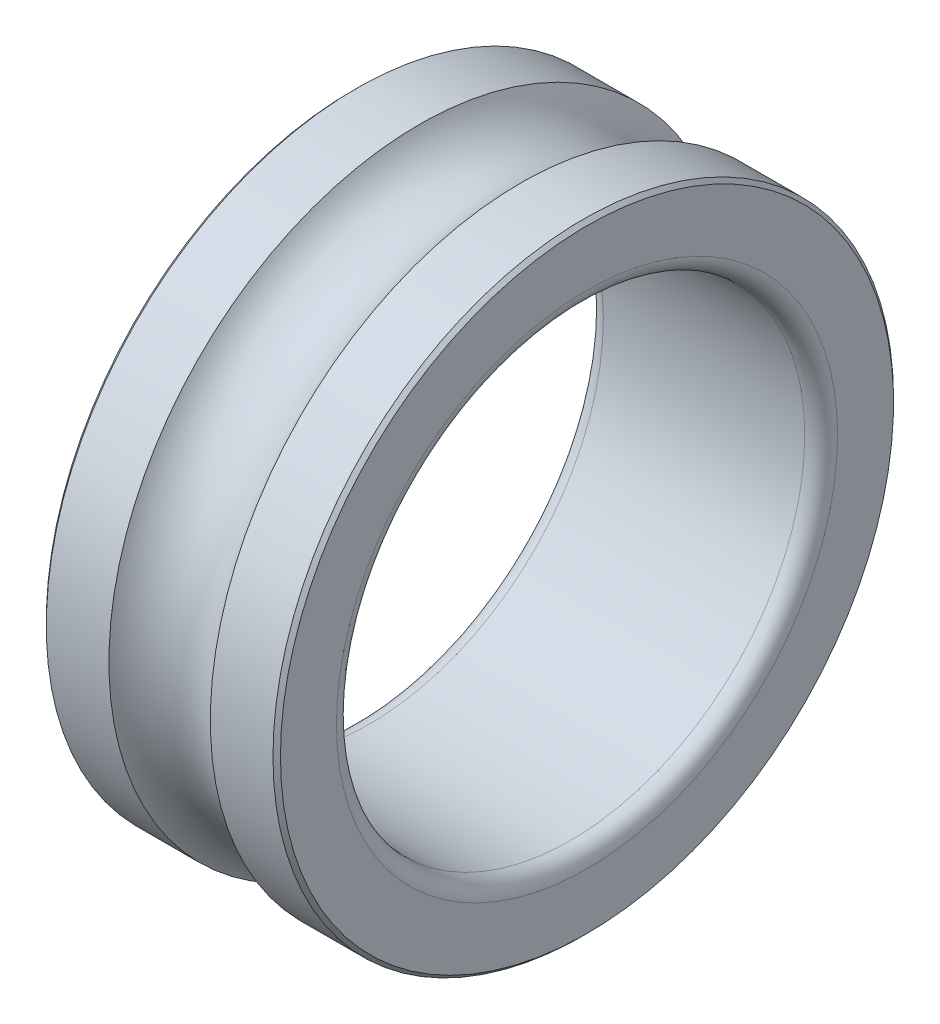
ISO-10303-21;
HEADER;
FILE_DESCRIPTION(('STEP AP214'),'2;1');
FILE_NAME('part.step','',(''),(''),'','','');
FILE_SCHEMA(('AUTOMOTIVE_DESIGN { 1 0 10303 214 1 1 1 1 }'));
ENDSEC;
DATA;
#1=APPLICATION_CONTEXT('core data for automotive mechanical design processes');
#2=APPLICATION_PROTOCOL_DEFINITION('international standard','automotive_design',2000,#1);
#3=PRODUCT_CONTEXT('',#1,'mechanical');
#4=PRODUCT('Part','Part','',(#3));
#5=PRODUCT_RELATED_PRODUCT_CATEGORY('part','',(#4));
#6=PRODUCT_DEFINITION_FORMATION('','',#4);
#7=PRODUCT_DEFINITION_CONTEXT('part definition',#1,'design');
#8=PRODUCT_DEFINITION('design','',#6,#7);
#9=PRODUCT_DEFINITION_SHAPE('','',#8);
#10=(LENGTH_UNIT() NAMED_UNIT(*) SI_UNIT(.MILLI.,.METRE.));
#11=(NAMED_UNIT(*) PLANE_ANGLE_UNIT() SI_UNIT($,.RADIAN.));
#12=(NAMED_UNIT(*) SI_UNIT($,.STERADIAN.) SOLID_ANGLE_UNIT());
#13=UNCERTAINTY_MEASURE_WITH_UNIT(LENGTH_MEASURE(1.E-05),#10,'distance_accuracy_value','');
#14=(GEOMETRIC_REPRESENTATION_CONTEXT(3) GLOBAL_UNCERTAINTY_ASSIGNED_CONTEXT((#13)) GLOBAL_UNIT_ASSIGNED_CONTEXT((#10,
#11,#12)) REPRESENTATION_CONTEXT('',''));
#15=CARTESIAN_POINT('',(0.,0.,0.));
#16=DIRECTION('',(0.,0.,1.));
#17=DIRECTION('',(1.,0.,0.));
#18=AXIS2_PLACEMENT_3D('',#15,#16,#17);
#19=CARTESIAN_POINT('',(-2.5,0.,0.));
#20=DIRECTION('',(1.,0.,0.));
#21=DIRECTION('',(0.,0.,-1.));
#22=AXIS2_PLACEMENT_3D('',#19,#20,#21);
#23=TOROIDAL_SURFACE('',#22,7.25,1.25);
#24=CARTESIAN_POINT('',(-1.41746824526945,0.,0.));
#25=DIRECTION('',(1.,0.,0.));
#26=DIRECTION('',(0.,0.,-1.));
#27=AXIS2_PLACEMENT_3D('',#24,#25,#26);
#28=CIRCLE('',#27,6.625);
#29=CARTESIAN_POINT('',(-1.41746824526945,0.,-6.625));
#30=VERTEX_POINT('',#29);
#31=EDGE_CURVE('E165',#30,#30,#28,.T.);
#32=ORIENTED_EDGE('',*,*,#31,.F.);
#33=EDGE_LOOP('',(#32));
#34=FACE_BOUND('',#33,.T.);
#35=CARTESIAN_POINT('',(-3.58253175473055,0.,0.));
#36=DIRECTION('',(1.,0.,0.));
#37=DIRECTION('',(0.,0.,-1.));
#38=AXIS2_PLACEMENT_3D('',#35,#36,#37);
#39=CIRCLE('',#38,6.625);
#40=CARTESIAN_POINT('',(-3.58253175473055,0.,-6.625));
#41=VERTEX_POINT('',#40);
#42=EDGE_CURVE('E160',#41,#41,#39,.F.);
#43=ORIENTED_EDGE('',*,*,#42,.F.);
#44=EDGE_LOOP('',(#43));
#45=FACE_BOUND('',#44,.T.);
#46=ADVANCED_FACE('F17',(#34,#45),#23,.F.);
#47=CARTESIAN_POINT('',(0.,0.,0.));
#48=DIRECTION('',(1.,0.,0.));
#49=DIRECTION('',(0.,0.,-1.));
#50=AXIS2_PLACEMENT_3D('',#47,#48,#49);
#51=CYLINDRICAL_SURFACE('',#50,6.625);
#52=CARTESIAN_POINT('',(-0.0799999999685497,0.,0.));
#53=DIRECTION('',(-1.,0.,0.));
#54=DIRECTION('',(0.,0.,1.));
#55=AXIS2_PLACEMENT_3D('',#52,#53,#54);
#56=CIRCLE('',#55,6.62499999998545);
#57=CARTESIAN_POINT('',(-0.0799999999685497,0.,6.62499999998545));
#58=VERTEX_POINT('',#57);
#59=EDGE_CURVE('E158',#58,#58,#56,.F.);
#60=ORIENTED_EDGE('',*,*,#59,.F.);
#61=EDGE_LOOP('',(#60));
#62=FACE_BOUND('',#61,.T.);
#63=ORIENTED_EDGE('',*,*,#31,.T.);
#64=EDGE_LOOP('',(#63));
#65=FACE_BOUND('',#64,.T.);
#66=ADVANCED_FACE('F100',(#62,#65),#51,.T.);
#67=CARTESIAN_POINT('',(0.,0.,0.));
#68=DIRECTION('',(1.,0.,0.));
#69=DIRECTION('',(0.,0.,-1.));
#70=AXIS2_PLACEMENT_3D('',#67,#68,#69);
#71=CYLINDRICAL_SURFACE('',#70,6.625);
#72=CARTESIAN_POINT('',(-4.9200000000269,0.,0.));
#73=DIRECTION('',(1.,0.,0.));
#74=DIRECTION('',(0.,0.,-1.));
#75=AXIS2_PLACEMENT_3D('',#72,#73,#74);
#76=CIRCLE('',#75,6.62499999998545);
#77=CARTESIAN_POINT('',(-4.9200000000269,0.,-6.62499999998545));
#78=VERTEX_POINT('',#77);
#79=EDGE_CURVE('E155',#78,#78,#76,.F.);
#80=ORIENTED_EDGE('',*,*,#79,.F.);
#81=EDGE_LOOP('',(#80));
#82=FACE_BOUND('',#81,.T.);
#83=ORIENTED_EDGE('',*,*,#42,.T.);
#84=EDGE_LOOP('',(#83));
#85=FACE_BOUND('',#84,.T.);
#86=ADVANCED_FACE('F97',(#82,#85),#71,.T.);
#87=CARTESIAN_POINT('',(-0.0799999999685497,0.,0.));
#88=DIRECTION('',(-1.,0.,0.));
#89=DIRECTION('',(0.,0.,1.));
#90=AXIS2_PLACEMENT_3D('',#87,#88,#89);
#91=CONICAL_SURFACE('',#90,6.62499999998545,0.78539816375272);
#92=ORIENTED_EDGE('',*,*,#59,.T.);
#93=EDGE_LOOP('',(#92));
#94=FACE_BOUND('',#93,.T.);
#95=CARTESIAN_POINT('',(0.,0.,0.));
#96=DIRECTION('',(-1.,0.,0.));
#97=DIRECTION('',(0.,0.,1.));
#98=AXIS2_PLACEMENT_3D('',#95,#96,#97);
#99=CIRCLE('',#98,6.54499999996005);
#100=CARTESIAN_POINT('',(0.,0.,6.54499999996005));
#101=VERTEX_POINT('',#100);
#102=EDGE_CURVE('E61',#101,#101,#99,.F.);
#103=ORIENTED_EDGE('',*,*,#102,.F.);
#104=EDGE_LOOP('',(#103));
#105=FACE_BOUND('',#104,.T.);
#106=ADVANCED_FACE('F93',(#94,#105),#91,.T.);
#107=CARTESIAN_POINT('',(-4.92000000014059,0.,0.));
#108=DIRECTION('',(1.,0.,0.));
#109=DIRECTION('',(0.,0.,-1.));
#110=AXIS2_PLACEMENT_3D('',#107,#108,#109);
#111=CONICAL_SURFACE('',#110,6.62499999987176,0.785398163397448);
#112=CARTESIAN_POINT('',(-4.99999999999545,0.,0.));
#113=DIRECTION('',(1.,0.,0.));
#114=DIRECTION('',(0.,0.,-1.));
#115=AXIS2_PLACEMENT_3D('',#112,#113,#114);
#116=CIRCLE('',#115,6.5450000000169);
#117=CARTESIAN_POINT('',(-4.99999999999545,0.,-6.5450000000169));
#118=VERTEX_POINT('',#117);
#119=EDGE_CURVE('E55',#118,#118,#116,.F.);
#120=ORIENTED_EDGE('',*,*,#119,.F.);
#121=EDGE_LOOP('',(#120));
#122=FACE_BOUND('',#121,.T.);
#123=ORIENTED_EDGE('',*,*,#79,.T.);
#124=EDGE_LOOP('',(#123));
#125=FACE_BOUND('',#124,.T.);
#126=ADVANCED_FACE('F80',(#122,#125),#111,.T.);
#127=CARTESIAN_POINT('',(0.,5.35,0.));
#128=DIRECTION('',(1.,0.,0.));
#129=DIRECTION('',(0.,0.,-1.));
#130=AXIS2_PLACEMENT_3D('',#127,#128,#129);
#131=PLANE('',#130);
#132=CARTESIAN_POINT('',(0.,0.,0.));
#133=DIRECTION('',(1.,0.,0.));
#134=DIRECTION('',(0.,0.,-1.));
#135=AXIS2_PLACEMENT_3D('',#132,#133,#134);
#136=CIRCLE('',#135,5.35);
#137=CARTESIAN_POINT('',(0.,0.,-5.35));
#138=VERTEX_POINT('',#137);
#139=CARTESIAN_POINT('',(0.,0.,5.35));
#140=VERTEX_POINT('',#139);
#141=EDGE_CURVE('E45',#138,#140,#136,.T.);
#142=ORIENTED_EDGE('',*,*,#141,.F.);
#143=CARTESIAN_POINT('',(0.,0.,0.));
#144=DIRECTION('',(1.,0.,0.));
#145=DIRECTION('',(0.,0.,1.));
#146=AXIS2_PLACEMENT_3D('',#143,#144,#145);
#147=CIRCLE('',#146,5.35);
#148=EDGE_CURVE('E48',#140,#138,#147,.T.);
#149=ORIENTED_EDGE('',*,*,#148,.F.);
#150=EDGE_LOOP('',(#142,#149));
#151=FACE_BOUND('',#150,.T.);
#152=ORIENTED_EDGE('',*,*,#102,.T.);
#153=EDGE_LOOP('',(#152));
#154=FACE_BOUND('',#153,.T.);
#155=ADVANCED_FACE('F59',(#151,#154),#131,.T.);
#156=CARTESIAN_POINT('',(-5.,5.35,0.));
#157=DIRECTION('',(-1.,0.,0.));
#158=DIRECTION('',(0.,0.,1.));
#159=AXIS2_PLACEMENT_3D('',#156,#157,#158);
#160=PLANE('',#159);
#161=ORIENTED_EDGE('',*,*,#119,.T.);
#162=EDGE_LOOP('',(#161));
#163=FACE_BOUND('',#162,.T.);
#164=CARTESIAN_POINT('',(-5.,0.,0.));
#165=DIRECTION('',(-1.,0.,0.));
#166=DIRECTION('',(0.,0.,1.));
#167=AXIS2_PLACEMENT_3D('',#164,#165,#166);
#168=CIRCLE('',#167,5.35);
#169=CARTESIAN_POINT('',(-5.,0.,-5.35));
#170=VERTEX_POINT('',#169);
#171=CARTESIAN_POINT('',(-5.,0.,5.35));
#172=VERTEX_POINT('',#171);
#173=EDGE_CURVE('E37',#170,#172,#168,.F.);
#174=ORIENTED_EDGE('',*,*,#173,.T.);
#175=CARTESIAN_POINT('',(-5.,0.,0.));
#176=DIRECTION('',(-1.,0.,0.));
#177=DIRECTION('',(0.,0.,-1.));
#178=AXIS2_PLACEMENT_3D('',#175,#176,#177);
#179=CIRCLE('',#178,5.35);
#180=EDGE_CURVE('E54',#170,#172,#179,.T.);
#181=ORIENTED_EDGE('',*,*,#180,.F.);
#182=EDGE_LOOP('',(#174,#181));
#183=FACE_BOUND('',#182,.T.);
#184=ADVANCED_FACE('F79',(#163,#183),#160,.T.);
#185=CARTESIAN_POINT('',(-0.35,0.,0.));
#186=DIRECTION('',(1.,0.,0.));
#187=DIRECTION('',(0.,0.,-1.));
#188=AXIS2_PLACEMENT_3D('',#185,#186,#187);
#189=TOROIDAL_SURFACE('',#188,5.35,0.35);
#190=ORIENTED_EDGE('',*,*,#141,.T.);
#191=ORIENTED_EDGE('',*,*,#148,.T.);
#192=EDGE_LOOP('',(#190,#191));
#193=FACE_BOUND('',#192,.T.);
#194=CARTESIAN_POINT('',(-0.350000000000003,0.,0.));
#195=DIRECTION('',(1.,0.,0.));
#196=DIRECTION('',(0.,0.,-1.));
#197=AXIS2_PLACEMENT_3D('',#194,#195,#196);
#198=CIRCLE('',#197,5.);
#199=CARTESIAN_POINT('',(-0.350000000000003,0.,-5.));
#200=VERTEX_POINT('',#199);
#201=EDGE_CURVE('E29',#200,#200,#198,.F.);
#202=ORIENTED_EDGE('',*,*,#201,.T.);
#203=EDGE_LOOP('',(#202));
#204=FACE_BOUND('',#203,.T.);
#205=ADVANCED_FACE('F50',(#193,#204),#189,.T.);
#206=CARTESIAN_POINT('',(-4.65,0.,0.));
#207=DIRECTION('',(1.,0.,0.));
#208=DIRECTION('',(0.,0.,-1.));
#209=AXIS2_PLACEMENT_3D('',#206,#207,#208);
#210=TOROIDAL_SURFACE('',#209,5.35,0.35);
#211=ORIENTED_EDGE('',*,*,#180,.T.);
#212=ORIENTED_EDGE('',*,*,#173,.F.);
#213=EDGE_LOOP('',(#211,#212));
#214=FACE_BOUND('',#213,.T.);
#215=CARTESIAN_POINT('',(-4.65,0.,0.));
#216=DIRECTION('',(1.,0.,0.));
#217=DIRECTION('',(0.,0.,-1.));
#218=AXIS2_PLACEMENT_3D('',#215,#216,#217);
#219=CIRCLE('',#218,5.);
#220=CARTESIAN_POINT('',(-4.65,0.,-5.));
#221=VERTEX_POINT('',#220);
#222=EDGE_CURVE('E11',#221,#221,#219,.T.);
#223=ORIENTED_EDGE('',*,*,#222,.T.);
#224=EDGE_LOOP('',(#223));
#225=FACE_BOUND('',#224,.T.);
#226=ADVANCED_FACE('F113',(#214,#225),#210,.T.);
#227=CARTESIAN_POINT('',(0.,0.,0.));
#228=DIRECTION('',(1.,0.,0.));
#229=DIRECTION('',(0.,0.,-1.));
#230=AXIS2_PLACEMENT_3D('',#227,#228,#229);
#231=CYLINDRICAL_SURFACE('',#230,5.);
#232=ORIENTED_EDGE('',*,*,#201,.F.);
#233=EDGE_LOOP('',(#232));
#234=FACE_BOUND('',#233,.T.);
#235=ORIENTED_EDGE('',*,*,#222,.F.);
#236=EDGE_LOOP('',(#235));
#237=FACE_BOUND('',#236,.T.);
#238=ADVANCED_FACE('F111',(#234,#237),#231,.F.);
#239=CLOSED_SHELL('',(#46,#66,#86,#106,#126,#155,#184,#205,#226,#238));
#240=MANIFOLD_SOLID_BREP('B1',#239);
#241=ADVANCED_BREP_SHAPE_REPRESENTATION('',(#18,#240),#14);
#242=SHAPE_DEFINITION_REPRESENTATION(#9,#241);
ENDSEC;
END-ISO-10303-21;
